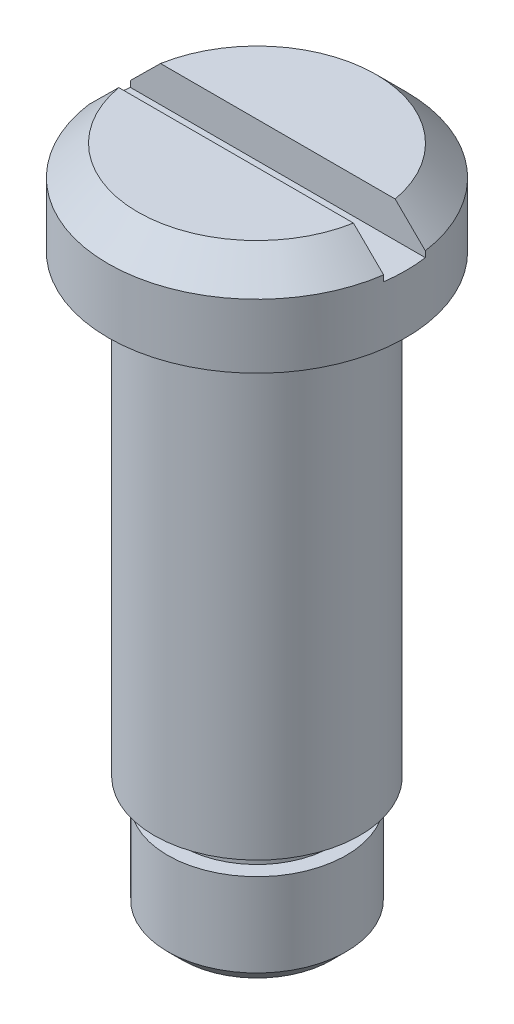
from build123d import *

# Parameters (mm, degrees)
ESQUISSE2_W             = 15
ESQUISSE2_H             = 1.4
ENL_V_MAT_EXTRU_1_DEPTH = 1.2


with BuildPart() as part:
    # Esquisse1 → Base-R_volution (revolve)
    with BuildSketch(Plane.XY, mode=Mode.PRIVATE) as base_r_volution_sk:
        Polygon((0, 0), (-2.5, 0), (-3, 0.5), (-3, 3.3), (-2.5, 3.3), (-2.5, 4.1), (-3.45, 4.1), (-3.45, 19.35), (-5, 19.35), (-5, 21.5), (-4, 22.5), (0, 22.5), align=None)
    revolve(base_r_volution_sk.sketch.rotate(Axis((0, 40, 0), (0, -1, 0)), 270), axis=Axis((0, 40, 0), (0, -1, 0)))

    # Esquisse2 → Enl_v. mat.-Extru.1 (cut)
    with BuildSketch(Plane(origin=(0, 22.5, 0), x_dir=(-1, 0, 0), z_dir=(0, 1, 0))):
        Rectangle(ESQUISSE2_W, ESQUISSE2_H)
    extrude(amount=-ENL_V_MAT_EXTRU_1_DEPTH, mode=Mode.SUBTRACT)


solid = part.part
